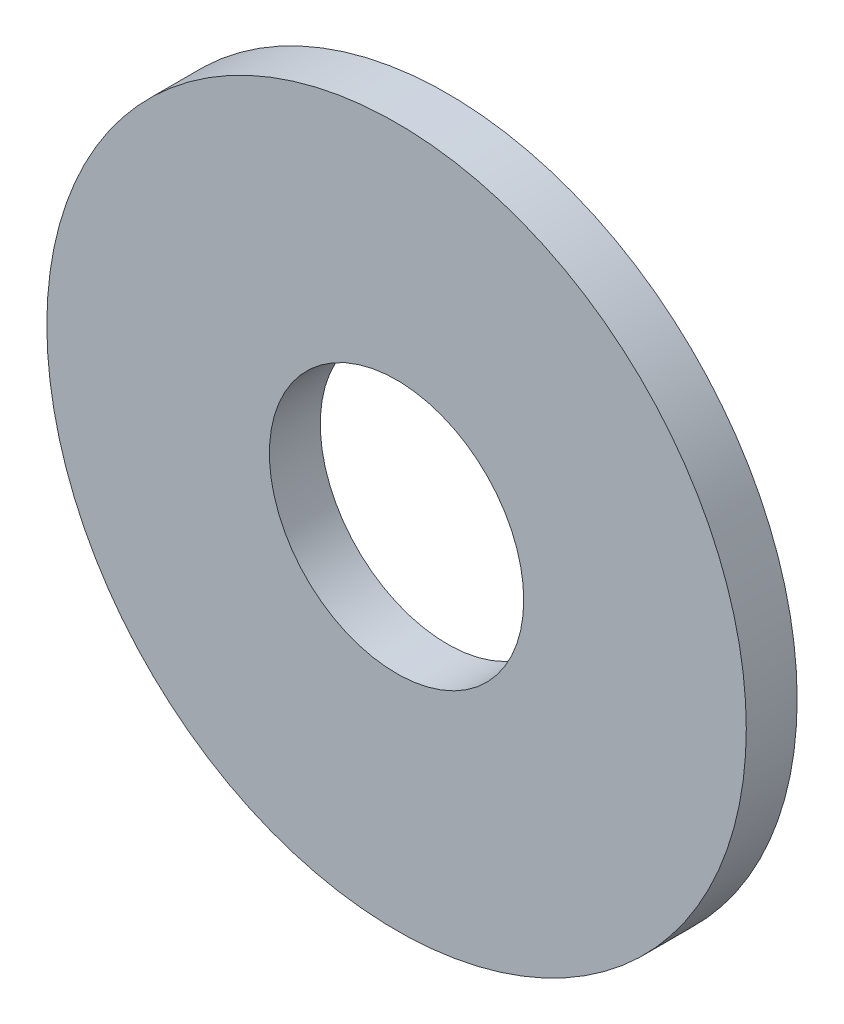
from build123d import *

# Parameters (mm, degrees)
ESQUISSE1_R        = 27.5
ESQUISSE1_R_2      = 10
BOSS_EXTRU_1_DEPTH = 4


with BuildPart() as part:
    # Esquisse1 → Boss.-Extru.1 (new body)
    with BuildSketch(Plane.XY):
        Circle(ESQUISSE1_R)
        Circle(ESQUISSE1_R_2, mode=Mode.SUBTRACT)
    extrude(amount=BOSS_EXTRU_1_DEPTH)


solid = part.part
